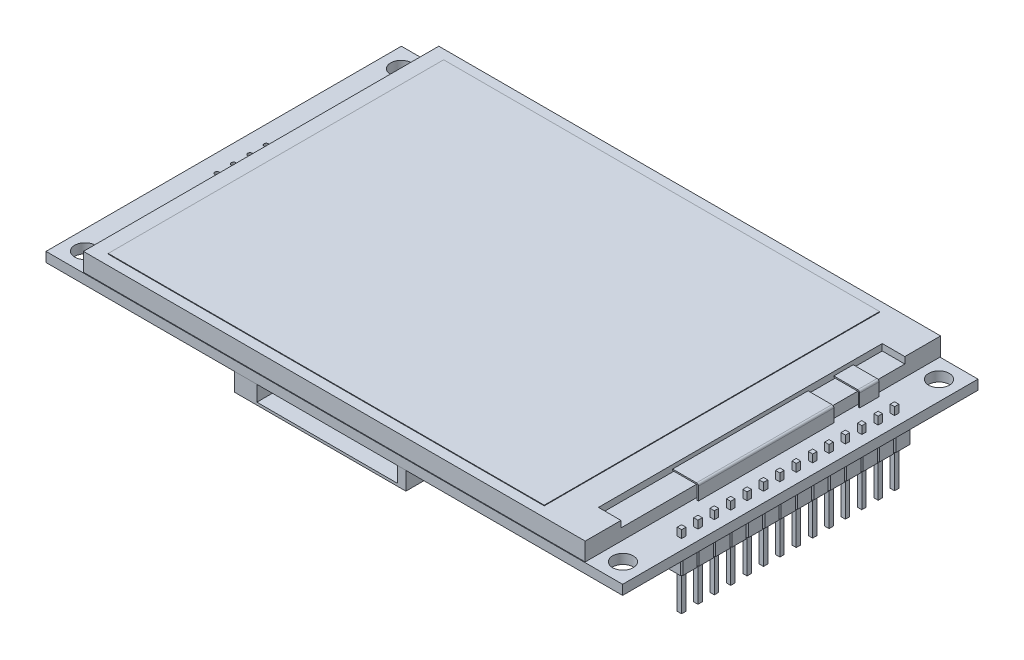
from build123d import *

# Parameters (mm, degrees)
SKIZZE1_W                         = 67.6
SKIZZE1_H                         = 52
AUFSATZ_LINEAR_AUSTRAGEN1_DEPTH   = 0.1
SKIZZE2_W                         = 77.8
SKIZZE2_H                         = 55.1
AUFSATZ_LINEAR_AUSTRAGEN2_DEPTH   = 2.8
AUFSATZ_LINEAR_START              = 0.1
SKIZZE3_W                         = 89.4
SKIZZE3_H                         = 55.1
AUFSATZ_LINEAR_AUSTRAGEN3_DEPTH   = 1.5
SKIZZE4_R                         = 1.6
SCHNITT_LINEAR_AUSTRAGEN1_DEPTH   = 55.993204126
AUFSATZ_LINEAR_AUSTRAGEN4_DEPTH   = 2.6
LINEARES_MUSTER1_COUNT            = 14
LINEARES_MUSTER1_PITCH            = 2.54
AUFSATZ_LINEAR_START_2            = -5.3
SKIZZE7_W                         = 0.67
SKIZZE7_H                         = 0.67
AUFSATZ_LINEAR_AUSTRAGEN5_DEPTH   = 11.3
LINEARES_MUSTER3_COUNT            = 14
LINEARES_MUSTER3_PITCH            = 2.54
SKIZZE8_R                         = 0.35
SCHNITT_LINEAR_AUSTRAGEN2_DEPTH   = 56.580684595
LINEARES_MUSTER2_COUNT            = 4
LINEARES_MUSTER2_PITCH            = 2.54
AUFSATZ_LINEAR_AUSTRAGEN6_DEPTH   = 2.8
SKIZZE10_W                        = 21.8
SKIZZE10_H                        = 14
SCHNITT_LINEAR_AUSTRAGEN3_DEPTH   = 2.4
SKIZZE11_W                        = 1.3
SKIZZE11_H                        = 3
AUFSATZ_LINEAR_AUSTRAGEN7_DEPTH   = 1
SKIZZE11_W_2                      = 3
SKIZZE11_H_2                      = 1.3
AUFSATZ_LINEAR_AUSTRAGEN7_2_DEPTH = 1
SKIZZE12_W                        = 0.9
SKIZZE12_H                        = 2
AUFSATZ_LINEAR_AUSTRAGEN8_DEPTH   = 0.6
AUFSATZ_LINEAR_AUSTRAGEN8_2_DEPTH = 0.6
AUFSATZ_LINEAR_AUSTRAGEN8_3_DEPTH = 0.6
AUFSATZ_LINEAR_AUSTRAGEN8_4_DEPTH = 0.6
AUFSATZ_LINEAR_AUSTRAGEN8_5_DEPTH = 0.6
AUFSATZ_LINEAR_AUSTRAGEN8_6_DEPTH = 0.6
AUFSATZ_LINEAR_AUSTRAGEN8_7_DEPTH = 0.6
AUFSATZ_LINEAR_AUSTRAGEN8_8_DEPTH = 0.6
SKIZZE13_W                        = 3.5
SKIZZE13_H                        = 44
SCHNITT_LINEAR_AUSTRAGEN4_DEPTH   = 1
AUFSATZ_LINEAR_AUSTRAGEN9_DEPTH   = 10.5
AUFSATZ_LINEAR_START_3            = -14.5
AUFSATZ_LINEAR_AUSTRAGEN10_DEPTH  = 3


with BuildPart() as part:
    # Skizze1 → Aufsatz-Linear austragen1 (new body)
    with BuildSketch(Plane(origin=(0, 0, 0), x_dir=(1, 0, 0), z_dir=(0, 1, 0))):
        Rectangle(SKIZZE1_W, SKIZZE1_H)
    extrude(amount=AUFSATZ_LINEAR_AUSTRAGEN1_DEPTH)


with BuildPart() as body_2:
    # Skizze2 → Aufsatz-Linear austragen2 (new body)
    with BuildSketch(Plane.XZ):
        with Locations((2.8, 0)):
            Rectangle(SKIZZE2_W, SKIZZE2_H)
    extrude(amount=AUFSATZ_LINEAR_AUSTRAGEN2_DEPTH)

    # Skizze13 → Schnitt-Linear austragen4 (cut)
    with BuildSketch(Plane(origin=(0, 0, 0), x_dir=(1, 0, 0), z_dir=(0, 1, 0))):
        with Locations((39.95, 0)):
            Rectangle(SKIZZE13_W, SKIZZE13_H)
    extrude(amount=-SCHNITT_LINEAR_AUSTRAGEN4_DEPTH, mode=Mode.SUBTRACT)


with BuildPart() as body_3:
    # Skizze3 → Aufsatz-Linear austragen3 (new body)
    with BuildSketch(Plane.XZ.offset(2.8).offset(AUFSATZ_LINEAR_START)):
        with Locations((2.8, 0)):
            Rectangle(SKIZZE3_W, SKIZZE3_H)
    extrude(amount=AUFSATZ_LINEAR_AUSTRAGEN3_DEPTH)

    # Skizze4 → Schnitt-Linear austragen1 (cut, through all)
    with BuildSketch(Plane(origin=(0, -2.9, 0), x_dir=(1, 0, 0), z_dir=(0, 1, 0))):
        with Locations(Location((44.5, 24.5, 0), (0, 0, 270))):
            Circle(SKIZZE4_R)
        with Locations(Location((44.5, -24.5, 0), (0, 0, 270))):
            Circle(SKIZZE4_R)
        with Locations(Location((-38.9, -24.5, 0), (0, 0, 270))):
            Circle(SKIZZE4_R)
        with Locations(Location((-38.9, 24.5, 0), (0, 0, 270))):
            Circle(SKIZZE4_R)
    extrude(amount=-SCHNITT_LINEAR_AUSTRAGEN1_DEPTH, mode=Mode.SUBTRACT)

    # Skizze6 → Aufsatz-Linear austragen4 (add)
    with BuildSketch(Plane.XZ.offset(4.4)):
        Polygon((46.7, 17.81), (46.9, 17.61), (46.9, 15.41), (46.7, 15.21), (44.5, 15.21), (44.3, 15.41), (44.3, 17.61), (44.5, 17.81), align=None)
    aufsatz_linear_austragen4 = extrude(amount=AUFSATZ_LINEAR_AUSTRAGEN4_DEPTH)

    # Lineares Muster1: Aufsatz-Linear austragen4 ×14
    with Locations(*[(0, 0, -i * LINEARES_MUSTER1_PITCH) for i in range(1, LINEARES_MUSTER1_COUNT)]):
        add(aufsatz_linear_austragen4)

    # Skizze8 → Schnitt-Linear austragen2 (cut, through all)
    with BuildSketch(Plane.XZ.offset(4.4)):
        with Locations(Location((-39.1, 3.81, 0), (0, 0, 270))):
            Circle(SKIZZE8_R)
    schnitt_linear_austragen2 = extrude(amount=-SCHNITT_LINEAR_AUSTRAGEN2_DEPTH, mode=Mode.SUBTRACT)

    # Lineares Muster2: Schnitt-Linear austragen2 ×4
    with Locations(*[(0, 0, -i * LINEARES_MUSTER2_PITCH) for i in range(1, LINEARES_MUSTER2_COUNT)]):
        add(schnitt_linear_austragen2, mode=Mode.SUBTRACT)


with BuildPart() as body_4:
    # Skizze7 → Aufsatz-Linear austragen5 (new body)
    with BuildSketch(Plane.XZ.offset(7).offset(AUFSATZ_LINEAR_START_2)):
        with Locations((45.6, 16.51)):
            Rectangle(SKIZZE7_W, SKIZZE7_H)
    aufsatz_linear_austragen5 = extrude(amount=AUFSATZ_LINEAR_AUSTRAGEN5_DEPTH)


with BuildPart() as lineares_muster3_1:
    # Lineares Muster3: Aufsatz-Linear austragen5 ×14
    with Locations(*[(0, 0, -i * LINEARES_MUSTER3_PITCH) for i in range(1, LINEARES_MUSTER3_COUNT)]):
        add(aufsatz_linear_austragen5)


with BuildPart() as body_18:
    # Skizze9 → Aufsatz-Linear austragen6 (new body)
    with BuildSketch(Plane.XZ.offset(4.4)):
        Polygon((13.9, 27.55), (13.9, 9.35), (-10.5, 9.35), (-10.5, 15.05), (-12.7, 17.55), (-12.7, 27.55), align=None)
    extrude(amount=AUFSATZ_LINEAR_AUSTRAGEN6_DEPTH)

    # Skizze10 → Schnitt-Linear austragen3 (cut)
    with BuildSketch(Plane.XZ.offset(4.4)):
        with Locations((1.7, 20.55)):
            Rectangle(SKIZZE10_W, SKIZZE10_H)
    extrude(amount=SCHNITT_LINEAR_AUSTRAGEN3_DEPTH, mode=Mode.SUBTRACT)


with BuildPart() as body_19:
    # Skizze11 → Aufsatz-Linear austragen7 (new body)
    with BuildSketch(Plane.XZ.offset(4.4)):
        with Locations((28.6, 3.85)):
            Rectangle(SKIZZE11_W, SKIZZE11_H)
    extrude(amount=AUFSATZ_LINEAR_AUSTRAGEN7_DEPTH)


with BuildPart() as body_20:
    # Skizze11 → Aufsatz-Linear austragen7 2 (new body)
    with BuildSketch(Plane.XZ.offset(4.4)):
        with Locations((28.5, -2.85)):
            Rectangle(SKIZZE11_W_2, SKIZZE11_H_2)
    extrude(amount=AUFSATZ_LINEAR_AUSTRAGEN7_2_DEPTH)


with BuildPart() as body_21:
    # Skizze12 → Aufsatz-Linear austragen8 (new body)
    with BuildSketch(Plane.XZ.offset(4.4)):
        with Locations((32, 3.85)):
            Rectangle(SKIZZE12_W, SKIZZE12_H)
    extrude(amount=AUFSATZ_LINEAR_AUSTRAGEN8_DEPTH)


with BuildPart() as body_22:
    # Skizze12 → Aufsatz-Linear austragen8 2 (new body)
    with BuildSketch(Plane.XZ.offset(4.4)):
        with Locations((25.2, 3.85)):
            Rectangle(SKIZZE12_W, SKIZZE12_H)
    extrude(amount=AUFSATZ_LINEAR_AUSTRAGEN8_2_DEPTH)


with BuildPart() as body_23:
    # Skizze12 → Aufsatz-Linear austragen8 3 (new body)
    with BuildSketch(Plane.XZ.offset(4.4)):
        with Locations((25.2, -2.85)):
            Rectangle(SKIZZE12_W, SKIZZE12_H)
    extrude(amount=AUFSATZ_LINEAR_AUSTRAGEN8_3_DEPTH)


with BuildPart() as body_24:
    # Skizze12 → Aufsatz-Linear austragen8 4 (new body)
    with BuildSketch(Plane.XZ.offset(4.4)):
        with Locations((32, -13.15)):
            Rectangle(SKIZZE12_W, SKIZZE12_H)
    extrude(amount=AUFSATZ_LINEAR_AUSTRAGEN8_4_DEPTH)


with BuildPart() as body_25:
    # Skizze12 → Aufsatz-Linear austragen8 5 (new body)
    with BuildSketch(Plane.XZ.offset(4.4)):
        with Locations((30.4, -13.15)):
            Rectangle(SKIZZE12_W, SKIZZE12_H)
    extrude(amount=AUFSATZ_LINEAR_AUSTRAGEN8_5_DEPTH)


with BuildPart() as body_26:
    # Skizze12 → Aufsatz-Linear austragen8 6 (new body)
    with BuildSketch(Plane.XZ.offset(4.4)):
        with Locations((3.45, -2.55)):
            Rectangle(SKIZZE12_W, SKIZZE12_H)
    extrude(amount=AUFSATZ_LINEAR_AUSTRAGEN8_6_DEPTH)


with BuildPart() as body_27:
    # Skizze12 → Aufsatz-Linear austragen8 7 (new body)
    with BuildSketch(Plane.XZ.offset(4.4)):
        with Locations((1.15, -2.55)):
            Rectangle(SKIZZE12_W, SKIZZE12_H)
    extrude(amount=AUFSATZ_LINEAR_AUSTRAGEN8_7_DEPTH)


with BuildPart() as body_28:
    # Skizze12 → Aufsatz-Linear austragen8 8 (new body)
    with BuildSketch(Plane.XZ.offset(4.4)):
        with Locations((-1.15, -2.55)):
            Rectangle(SKIZZE12_W, SKIZZE12_H)
    extrude(amount=AUFSATZ_LINEAR_AUSTRAGEN8_8_DEPTH)


with BuildPart() as body_29:
    # Skizze14 → Aufsatz-Linear austragen9 (new, symmetric)
    with BuildSketch(Plane.XY):
        with BuildLine():
            Line((38.2, -0.6), (38.2, -0.8))
            Line((38.2, -0.8), (41.9, -0.8))
            ThreePointArc((41.9, -0.8), (41.970710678, -0.829289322), (42, -0.9))
            Line((42, -0.9), (42, -2.9))
            Line((42, -2.9), (42.2, -2.9))
            Line((42.2, -2.9), (42.2, -0.9))
            ThreePointArc((42.2, -0.9), (42.112132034, -0.687867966), (41.9, -0.6))
            Line((41.9, -0.6), (38.2, -0.6))
        make_face()
    extrude(amount=AUFSATZ_LINEAR_AUSTRAGEN9_DEPTH, both=True)


with BuildPart() as body_30:
    # Skizze15 → Aufsatz-Linear austragen10 (new body)
    with BuildSketch(Plane.XY.offset(AUFSATZ_LINEAR_START_3)):
        with BuildLine():
            Line((38.2, -0.6), (38.2, -0.8))
            Line((38.2, -0.8), (41.9, -0.8))
            ThreePointArc((41.9, -0.8), (41.970710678, -0.829289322), (42, -0.9))
            Line((42, -0.9), (42, -2.9))
            Line((42, -2.9), (42.2, -2.9))
            Line((42.2, -2.9), (42.2, -0.9))
            ThreePointArc((42.2, -0.9), (42.112132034, -0.687867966), (41.9, -0.6))
            Line((41.9, -0.6), (38.2, -0.6))
        make_face()
    extrude(amount=-AUFSATZ_LINEAR_AUSTRAGEN10_DEPTH)


solid = Compound([part.part, body_2.part, body_3.part, body_4.part, lineares_muster3_1.part, body_18.part, body_19.part, body_20.part, body_21.part, body_22.part, body_23.part, body_24.part, body_25.part, body_26.part, body_27.part, body_28.part, body_29.part, body_30.part])
